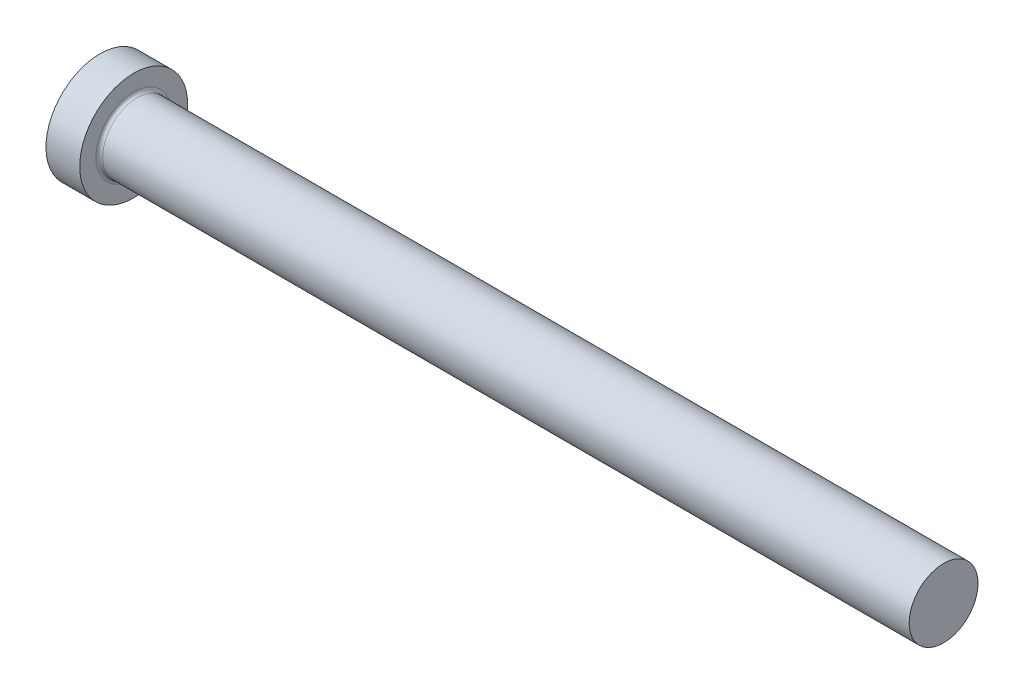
ISO-10303-21;
HEADER;
FILE_DESCRIPTION(('STEP AP214'),'2;1');
FILE_NAME('part.step','',(''),(''),'','','');
FILE_SCHEMA(('AUTOMOTIVE_DESIGN { 1 0 10303 214 1 1 1 1 }'));
ENDSEC;
DATA;
#1=APPLICATION_CONTEXT('core data for automotive mechanical design processes');
#2=APPLICATION_PROTOCOL_DEFINITION('international standard','automotive_design',2000,#1);
#3=PRODUCT_CONTEXT('',#1,'mechanical');
#4=PRODUCT('Part','Part','',(#3));
#5=PRODUCT_RELATED_PRODUCT_CATEGORY('part','',(#4));
#6=PRODUCT_DEFINITION_FORMATION('','',#4);
#7=PRODUCT_DEFINITION_CONTEXT('part definition',#1,'design');
#8=PRODUCT_DEFINITION('design','',#6,#7);
#9=PRODUCT_DEFINITION_SHAPE('','',#8);
#10=(LENGTH_UNIT() NAMED_UNIT(*) SI_UNIT(.MILLI.,.METRE.));
#11=(NAMED_UNIT(*) PLANE_ANGLE_UNIT() SI_UNIT($,.RADIAN.));
#12=(NAMED_UNIT(*) SI_UNIT($,.STERADIAN.) SOLID_ANGLE_UNIT());
#13=UNCERTAINTY_MEASURE_WITH_UNIT(LENGTH_MEASURE(1.E-05),#10,'distance_accuracy_value','');
#14=(GEOMETRIC_REPRESENTATION_CONTEXT(3) GLOBAL_UNCERTAINTY_ASSIGNED_CONTEXT((#13)) GLOBAL_UNIT_ASSIGNED_CONTEXT((#10,
#11,#12)) REPRESENTATION_CONTEXT('',''));
#15=CARTESIAN_POINT('',(0.,0.,0.));
#16=DIRECTION('',(0.,0.,1.));
#17=DIRECTION('',(1.,0.,0.));
#18=AXIS2_PLACEMENT_3D('',#15,#16,#17);
#19=CARTESIAN_POINT('',(0.,0.,0.));
#20=DIRECTION('',(-1.,0.,0.));
#21=DIRECTION('',(0.,-1.,0.));
#22=AXIS2_PLACEMENT_3D('',#19,#20,#21);
#23=PLANE('',#22);
#24=CARTESIAN_POINT('',(0.,0.,0.));
#25=DIRECTION('',(1.,0.,0.));
#26=DIRECTION('',(0.,1.,0.));
#27=AXIS2_PLACEMENT_3D('',#24,#25,#26);
#28=CIRCLE('',#27,8.);
#29=CARTESIAN_POINT('',(0.,8.,0.));
#30=VERTEX_POINT('',#29);
#31=EDGE_CURVE('E25',#30,#30,#28,.T.);
#32=ORIENTED_EDGE('',*,*,#31,.F.);
#33=EDGE_LOOP('',(#32));
#34=FACE_BOUND('',#33,.T.);
#35=ADVANCED_FACE('F14',(#34),#23,.T.);
#36=CARTESIAN_POINT('',(125.,0.,0.));
#37=DIRECTION('',(1.,0.,0.));
#38=DIRECTION('',(0.,1.,0.));
#39=AXIS2_PLACEMENT_3D('',#36,#37,#38);
#40=CYLINDRICAL_SURFACE('',#39,8.);
#41=ORIENTED_EDGE('',*,*,#31,.T.);
#42=EDGE_LOOP('',(#41));
#43=FACE_BOUND('',#42,.T.);
#44=CARTESIAN_POINT('',(5.,0.,0.));
#45=DIRECTION('',(1.,0.,0.));
#46=DIRECTION('',(0.,1.,0.));
#47=AXIS2_PLACEMENT_3D('',#44,#45,#46);
#48=CIRCLE('',#47,8.);
#49=CARTESIAN_POINT('',(5.,8.,0.));
#50=VERTEX_POINT('',#49);
#51=EDGE_CURVE('E29',#50,#50,#48,.T.);
#52=ORIENTED_EDGE('',*,*,#51,.F.);
#53=EDGE_LOOP('',(#52));
#54=FACE_BOUND('',#53,.T.);
#55=ADVANCED_FACE('F51',(#43,#54),#40,.T.);
#56=CARTESIAN_POINT('',(5.,8.,0.));
#57=DIRECTION('',(1.,0.,0.));
#58=DIRECTION('',(0.,1.,0.));
#59=AXIS2_PLACEMENT_3D('',#56,#57,#58);
#60=PLANE('',#59);
#61=CARTESIAN_POINT('',(5.,0.,0.));
#62=DIRECTION('',(1.,0.,0.));
#63=DIRECTION('',(0.,1.,0.));
#64=AXIS2_PLACEMENT_3D('',#61,#62,#63);
#65=CIRCLE('',#64,5.6);
#66=CARTESIAN_POINT('',(5.,5.6,0.));
#67=VERTEX_POINT('',#66);
#68=EDGE_CURVE('E9',#67,#67,#65,.F.);
#69=ORIENTED_EDGE('',*,*,#68,.T.);
#70=EDGE_LOOP('',(#69));
#71=FACE_BOUND('',#70,.T.);
#72=ORIENTED_EDGE('',*,*,#51,.T.);
#73=EDGE_LOOP('',(#72));
#74=FACE_BOUND('',#73,.T.);
#75=ADVANCED_FACE('F42',(#71,#74),#60,.T.);
#76=CARTESIAN_POINT('',(125.,0.,0.));
#77=DIRECTION('',(1.,0.,0.));
#78=DIRECTION('',(0.,1.,0.));
#79=AXIS2_PLACEMENT_3D('',#76,#77,#78);
#80=CYLINDRICAL_SURFACE('',#79,5.1);
#81=CARTESIAN_POINT('',(5.5,0.,0.));
#82=DIRECTION('',(1.,0.,0.));
#83=DIRECTION('',(0.,1.,0.));
#84=AXIS2_PLACEMENT_3D('',#81,#82,#83);
#85=CIRCLE('',#84,5.1);
#86=CARTESIAN_POINT('',(5.5,5.1,0.));
#87=VERTEX_POINT('',#86);
#88=EDGE_CURVE('E21',#87,#87,#85,.T.);
#89=ORIENTED_EDGE('',*,*,#88,.T.);
#90=EDGE_LOOP('',(#89));
#91=FACE_BOUND('',#90,.T.);
#92=CARTESIAN_POINT('',(125.,0.,0.));
#93=DIRECTION('',(1.,0.,0.));
#94=DIRECTION('',(0.,1.,0.));
#95=AXIS2_PLACEMENT_3D('',#92,#93,#94);
#96=CIRCLE('',#95,5.1);
#97=CARTESIAN_POINT('',(125.,5.1,0.));
#98=VERTEX_POINT('',#97);
#99=EDGE_CURVE('E34',#98,#98,#96,.T.);
#100=ORIENTED_EDGE('',*,*,#99,.F.);
#101=EDGE_LOOP('',(#100));
#102=FACE_BOUND('',#101,.T.);
#103=ADVANCED_FACE('F40',(#91,#102),#80,.T.);
#104=CARTESIAN_POINT('',(125.,5.1,0.));
#105=DIRECTION('',(1.,0.,0.));
#106=DIRECTION('',(0.,1.,0.));
#107=AXIS2_PLACEMENT_3D('',#104,#105,#106);
#108=PLANE('',#107);
#109=ORIENTED_EDGE('',*,*,#99,.T.);
#110=EDGE_LOOP('',(#109));
#111=FACE_BOUND('',#110,.T.);
#112=ADVANCED_FACE('F38',(#111),#108,.T.);
#113=CARTESIAN_POINT('',(5.5,0.,0.));
#114=DIRECTION('',(1.,0.,0.));
#115=DIRECTION('',(0.,1.,0.));
#116=AXIS2_PLACEMENT_3D('',#113,#114,#115);
#117=TOROIDAL_SURFACE('',#116,5.6,0.5);
#118=ORIENTED_EDGE('',*,*,#68,.F.);
#119=EDGE_LOOP('',(#118));
#120=FACE_BOUND('',#119,.T.);
#121=ORIENTED_EDGE('',*,*,#88,.F.);
#122=EDGE_LOOP('',(#121));
#123=FACE_BOUND('',#122,.T.);
#124=ADVANCED_FACE('F16',(#120,#123),#117,.F.);
#125=CLOSED_SHELL('',(#35,#55,#75,#103,#112,#124));
#126=MANIFOLD_SOLID_BREP('B1',#125);
#127=ADVANCED_BREP_SHAPE_REPRESENTATION('',(#18,#126),#14);
#128=SHAPE_DEFINITION_REPRESENTATION(#9,#127);
ENDSEC;
END-ISO-10303-21;
